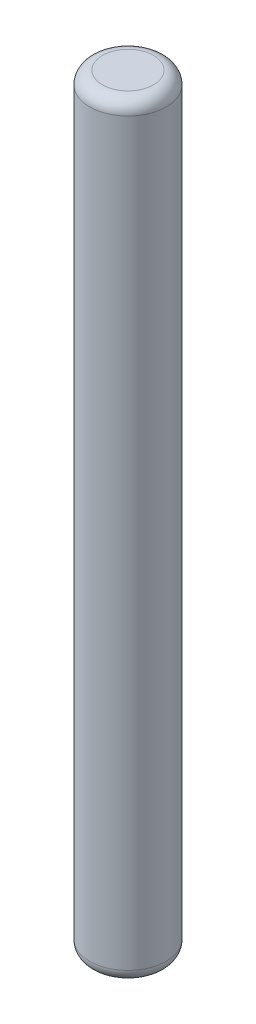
ISO-10303-21;
HEADER;
FILE_DESCRIPTION(('STEP AP214'),'2;1');
FILE_NAME('part.step','',(''),(''),'','','');
FILE_SCHEMA(('AUTOMOTIVE_DESIGN { 1 0 10303 214 1 1 1 1 }'));
ENDSEC;
DATA;
#1=APPLICATION_CONTEXT('core data for automotive mechanical design processes');
#2=APPLICATION_PROTOCOL_DEFINITION('international standard','automotive_design',2000,#1);
#3=PRODUCT_CONTEXT('',#1,'mechanical');
#4=PRODUCT('Part','Part','',(#3));
#5=PRODUCT_RELATED_PRODUCT_CATEGORY('part','',(#4));
#6=PRODUCT_DEFINITION_FORMATION('','',#4);
#7=PRODUCT_DEFINITION_CONTEXT('part definition',#1,'design');
#8=PRODUCT_DEFINITION('design','',#6,#7);
#9=PRODUCT_DEFINITION_SHAPE('','',#8);
#10=(LENGTH_UNIT() NAMED_UNIT(*) SI_UNIT(.MILLI.,.METRE.));
#11=(NAMED_UNIT(*) PLANE_ANGLE_UNIT() SI_UNIT($,.RADIAN.));
#12=(NAMED_UNIT(*) SI_UNIT($,.STERADIAN.) SOLID_ANGLE_UNIT());
#13=UNCERTAINTY_MEASURE_WITH_UNIT(LENGTH_MEASURE(1.E-05),#10,'distance_accuracy_value','');
#14=(GEOMETRIC_REPRESENTATION_CONTEXT(3) GLOBAL_UNCERTAINTY_ASSIGNED_CONTEXT((#13)) GLOBAL_UNIT_ASSIGNED_CONTEXT((#10,
#11,#12)) REPRESENTATION_CONTEXT('',''));
#15=CARTESIAN_POINT('',(0.,0.,0.));
#16=DIRECTION('',(0.,0.,1.));
#17=DIRECTION('',(1.,0.,0.));
#18=AXIS2_PLACEMENT_3D('',#15,#16,#17);
#19=CARTESIAN_POINT('',(0.,7.5,0.));
#20=DIRECTION('',(0.,-1.,0.));
#21=DIRECTION('',(0.,0.,-1.));
#22=AXIS2_PLACEMENT_3D('',#19,#20,#21);
#23=CYLINDRICAL_SURFACE('',#22,0.75);
#24=CARTESIAN_POINT('',(0.,-7.25,0.));
#25=DIRECTION('',(0.,1.,0.));
#26=DIRECTION('',(0.,0.,1.));
#27=AXIS2_PLACEMENT_3D('',#24,#25,#26);
#28=CIRCLE('',#27,0.75);
#29=CARTESIAN_POINT('',(0.,-7.25,0.75));
#30=VERTEX_POINT('',#29);
#31=EDGE_CURVE('E40',#30,#30,#28,.T.);
#32=ORIENTED_EDGE('',*,*,#31,.T.);
#33=EDGE_LOOP('',(#32));
#34=FACE_BOUND('',#33,.T.);
#35=CARTESIAN_POINT('',(0.,7.25,0.));
#36=DIRECTION('',(0.,1.,0.));
#37=DIRECTION('',(0.,0.,1.));
#38=AXIS2_PLACEMENT_3D('',#35,#36,#37);
#39=CIRCLE('',#38,0.75);
#40=CARTESIAN_POINT('',(0.,7.25,0.75));
#41=VERTEX_POINT('',#40);
#42=EDGE_CURVE('E44',#41,#41,#39,.F.);
#43=ORIENTED_EDGE('',*,*,#42,.T.);
#44=EDGE_LOOP('',(#43));
#45=FACE_BOUND('',#44,.T.);
#46=ADVANCED_FACE('F29',(#34,#45),#23,.T.);
#47=CARTESIAN_POINT('',(0.,7.5,0.));
#48=DIRECTION('',(0.,1.,0.));
#49=DIRECTION('',(0.,0.,1.));
#50=AXIS2_PLACEMENT_3D('',#47,#48,#49);
#51=PLANE('',#50);
#52=CARTESIAN_POINT('',(0.,7.5,0.));
#53=DIRECTION('',(0.,1.,0.));
#54=DIRECTION('',(0.,0.,1.));
#55=AXIS2_PLACEMENT_3D('',#52,#53,#54);
#56=CIRCLE('',#55,0.5);
#57=CARTESIAN_POINT('',(0.,7.5,0.5));
#58=VERTEX_POINT('',#57);
#59=EDGE_CURVE('E10',#58,#58,#56,.T.);
#60=ORIENTED_EDGE('',*,*,#59,.T.);
#61=EDGE_LOOP('',(#60));
#62=FACE_BOUND('',#61,.T.);
#63=ADVANCED_FACE('F60',(#62),#51,.T.);
#64=CARTESIAN_POINT('',(0.,-7.5,0.));
#65=DIRECTION('',(0.,1.,0.));
#66=DIRECTION('',(0.,0.,1.));
#67=AXIS2_PLACEMENT_3D('',#64,#65,#66);
#68=PLANE('',#67);
#69=CARTESIAN_POINT('',(0.,-7.5,0.));
#70=DIRECTION('',(0.,1.,0.));
#71=DIRECTION('',(0.,0.,1.));
#72=AXIS2_PLACEMENT_3D('',#69,#70,#71);
#73=CIRCLE('',#72,0.5);
#74=CARTESIAN_POINT('',(0.,-7.5,0.5));
#75=VERTEX_POINT('',#74);
#76=EDGE_CURVE('E36',#75,#75,#73,.F.);
#77=ORIENTED_EDGE('',*,*,#76,.T.);
#78=EDGE_LOOP('',(#77));
#79=FACE_BOUND('',#78,.T.);
#80=ADVANCED_FACE('F57',(#79),#68,.F.);
#81=CARTESIAN_POINT('',(0.,-7.25,0.));
#82=DIRECTION('',(0.,1.,0.));
#83=DIRECTION('',(0.,0.,1.));
#84=AXIS2_PLACEMENT_3D('',#81,#82,#83);
#85=TOROIDAL_SURFACE('',#84,0.5,0.25);
#86=ORIENTED_EDGE('',*,*,#76,.F.);
#87=EDGE_LOOP('',(#86));
#88=FACE_BOUND('',#87,.T.);
#89=ORIENTED_EDGE('',*,*,#31,.F.);
#90=EDGE_LOOP('',(#89));
#91=FACE_BOUND('',#90,.T.);
#92=ADVANCED_FACE('F53',(#88,#91),#85,.T.);
#93=CARTESIAN_POINT('',(0.,7.25,0.));
#94=DIRECTION('',(0.,1.,0.));
#95=DIRECTION('',(0.,0.,1.));
#96=AXIS2_PLACEMENT_3D('',#93,#94,#95);
#97=TOROIDAL_SURFACE('',#96,0.5,0.25);
#98=ORIENTED_EDGE('',*,*,#42,.F.);
#99=EDGE_LOOP('',(#98));
#100=FACE_BOUND('',#99,.T.);
#101=ORIENTED_EDGE('',*,*,#59,.F.);
#102=EDGE_LOOP('',(#101));
#103=FACE_BOUND('',#102,.T.);
#104=ADVANCED_FACE('F31',(#100,#103),#97,.T.);
#105=CLOSED_SHELL('',(#46,#63,#80,#92,#104));
#106=MANIFOLD_SOLID_BREP('B2',#105);
#107=ADVANCED_BREP_SHAPE_REPRESENTATION('',(#18,#106),#14);
#108=SHAPE_DEFINITION_REPRESENTATION(#9,#107);
ENDSEC;
END-ISO-10303-21;
